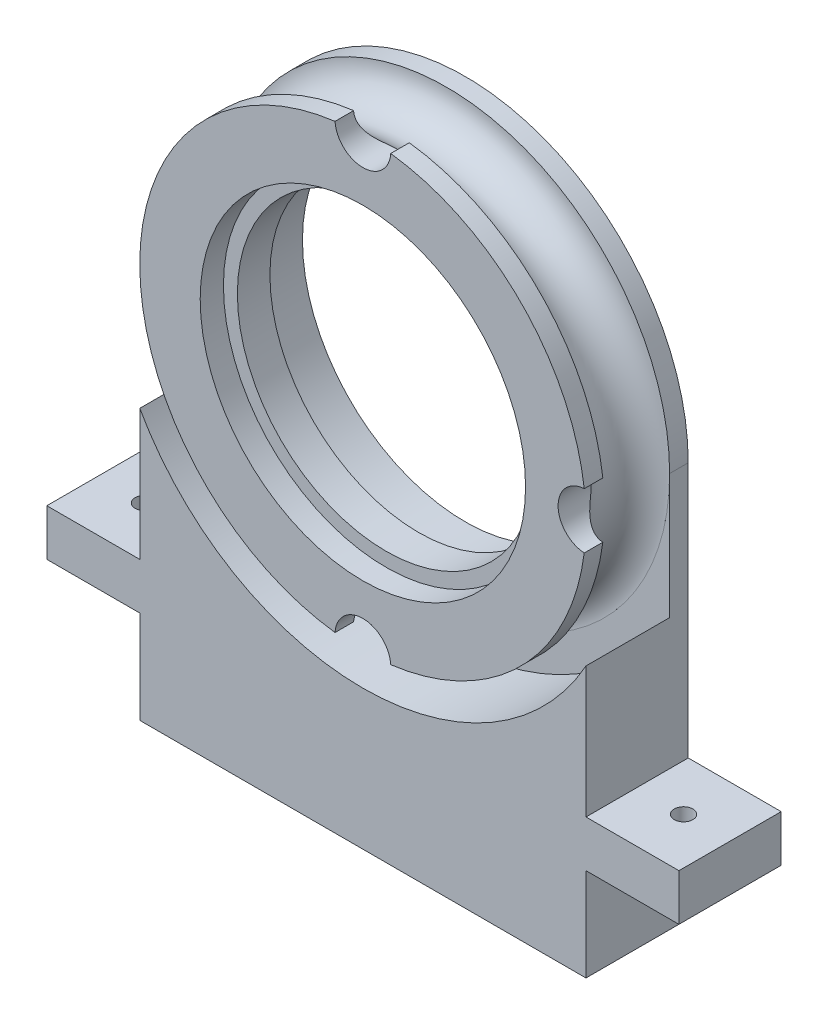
ISO-10303-21;
HEADER;
FILE_DESCRIPTION(('STEP AP214'),'2;1');
FILE_NAME('part.step','',(''),(''),'','','');
FILE_SCHEMA(('AUTOMOTIVE_DESIGN { 1 0 10303 214 1 1 1 1 }'));
ENDSEC;
DATA;
#1=APPLICATION_CONTEXT('core data for automotive mechanical design processes');
#2=APPLICATION_PROTOCOL_DEFINITION('international standard','automotive_design',2000,#1);
#3=PRODUCT_CONTEXT('',#1,'mechanical');
#4=PRODUCT('Part','Part','',(#3));
#5=PRODUCT_RELATED_PRODUCT_CATEGORY('part','',(#4));
#6=PRODUCT_DEFINITION_FORMATION('','',#4);
#7=PRODUCT_DEFINITION_CONTEXT('part definition',#1,'design');
#8=PRODUCT_DEFINITION('design','',#6,#7);
#9=PRODUCT_DEFINITION_SHAPE('','',#8);
#10=(LENGTH_UNIT() NAMED_UNIT(*) SI_UNIT(.MILLI.,.METRE.));
#11=(NAMED_UNIT(*) PLANE_ANGLE_UNIT() SI_UNIT($,.RADIAN.));
#12=(NAMED_UNIT(*) SI_UNIT($,.STERADIAN.) SOLID_ANGLE_UNIT());
#13=UNCERTAINTY_MEASURE_WITH_UNIT(LENGTH_MEASURE(1.E-05),#10,'distance_accuracy_value','');
#14=(GEOMETRIC_REPRESENTATION_CONTEXT(3) GLOBAL_UNCERTAINTY_ASSIGNED_CONTEXT((#13)) GLOBAL_UNIT_ASSIGNED_CONTEXT((#10,
#11,#12)) REPRESENTATION_CONTEXT('',''));
#15=CARTESIAN_POINT('',(0.,0.,0.));
#16=DIRECTION('',(0.,0.,1.));
#17=DIRECTION('',(1.,0.,0.));
#18=AXIS2_PLACEMENT_3D('',#15,#16,#17);
#19=CARTESIAN_POINT('',(0.,0.,11.));
#20=DIRECTION('',(0.,0.,1.));
#21=DIRECTION('',(1.,0.,0.));
#22=AXIS2_PLACEMENT_3D('',#19,#20,#21);
#23=PLANE('',#22);
#24=CARTESIAN_POINT('',(0.,0.,11.));
#25=DIRECTION('',(0.,0.,-1.));
#26=DIRECTION('',(1.,0.,0.));
#27=AXIS2_PLACEMENT_3D('',#24,#25,#26);
#28=CIRCLE('',#27,24.);
#29=CARTESIAN_POINT('',(23.8125,-2.99413489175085,11.));
#30=VERTEX_POINT('',#29);
#31=CARTESIAN_POINT('',(2.99413489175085,-23.8125,11.));
#32=VERTEX_POINT('',#31);
#33=EDGE_CURVE('E329',#30,#32,#28,.T.);
#34=ORIENTED_EDGE('',*,*,#33,.F.);
#35=CARTESIAN_POINT('',(24.,0.,11.));
#36=DIRECTION('',(0.,0.,1.));
#37=DIRECTION('',(1.,0.,0.));
#38=AXIS2_PLACEMENT_3D('',#35,#36,#37);
#39=CIRCLE('',#38,2.99999999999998);
#40=CARTESIAN_POINT('',(23.8125,2.99413489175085,11.));
#41=VERTEX_POINT('',#40);
#42=EDGE_CURVE('E479',#41,#30,#39,.T.);
#43=ORIENTED_EDGE('',*,*,#42,.F.);
#44=CARTESIAN_POINT('',(0.,0.,11.));
#45=DIRECTION('',(0.,0.,1.));
#46=DIRECTION('',(1.,0.,0.));
#47=AXIS2_PLACEMENT_3D('',#44,#45,#46);
#48=CIRCLE('',#47,24.);
#49=CARTESIAN_POINT('',(2.99413489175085,23.8125,11.));
#50=VERTEX_POINT('',#49);
#51=EDGE_CURVE('E333',#41,#50,#48,.T.);
#52=ORIENTED_EDGE('',*,*,#51,.T.);
#53=CARTESIAN_POINT('',(0.,24.,11.));
#54=DIRECTION('',(0.,0.,1.));
#55=DIRECTION('',(1.,0.,0.));
#56=AXIS2_PLACEMENT_3D('',#53,#54,#55);
#57=CIRCLE('',#56,2.99999999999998);
#58=CARTESIAN_POINT('',(-2.99413489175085,23.8125,11.));
#59=VERTEX_POINT('',#58);
#60=EDGE_CURVE('E470',#59,#50,#57,.T.);
#61=ORIENTED_EDGE('',*,*,#60,.F.);
#62=CARTESIAN_POINT('',(-2.99413489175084,-23.8125,11.));
#63=VERTEX_POINT('',#62);
#64=EDGE_CURVE('E338',#59,#63,#48,.T.);
#65=ORIENTED_EDGE('',*,*,#64,.T.);
#66=CARTESIAN_POINT('',(0.,-24.,11.));
#67=DIRECTION('',(0.,0.,1.));
#68=DIRECTION('',(1.,0.,0.));
#69=AXIS2_PLACEMENT_3D('',#66,#67,#68);
#70=CIRCLE('',#69,2.99999999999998);
#71=EDGE_CURVE('E235',#32,#63,#70,.T.);
#72=ORIENTED_EDGE('',*,*,#71,.F.);
#73=EDGE_LOOP('',(#34,#43,#52,#61,#65,#72));
#74=FACE_BOUND('',#73,.T.);
#75=CARTESIAN_POINT('',(0.,0.,11.));
#76=DIRECTION('',(0.,0.,1.));
#77=DIRECTION('',(1.,0.,0.));
#78=AXIS2_PLACEMENT_3D('',#75,#76,#77);
#79=CIRCLE('',#78,17.5);
#80=CARTESIAN_POINT('',(17.5,0.,11.));
#81=VERTEX_POINT('',#80);
#82=EDGE_CURVE('E230',#81,#81,#79,.T.);
#83=ORIENTED_EDGE('',*,*,#82,.F.);
#84=EDGE_LOOP('',(#83));
#85=FACE_BOUND('',#84,.T.);
#86=ADVANCED_FACE('F40',(#74,#85),#23,.T.);
#87=CARTESIAN_POINT('',(24.,-27.5,11.));
#88=DIRECTION('',(-1.,0.,0.));
#89=DIRECTION('',(0.,0.,1.));
#90=AXIS2_PLACEMENT_3D('',#87,#88,#89);
#91=PLANE('',#90);
#92=DIRECTION('',(0.,1.,0.));
#93=VECTOR('',#92,1.);
#94=CARTESIAN_POINT('',(24.,0.,2.));
#95=LINE('',#94,#93);
#96=CARTESIAN_POINT('',(24.,-13.4257215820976,2.));
#97=VERTEX_POINT('',#96);
#98=CARTESIAN_POINT('',(24.,0.,2.));
#99=VERTEX_POINT('',#98);
#100=EDGE_CURVE('E184',#97,#99,#95,.T.);
#101=ORIENTED_EDGE('',*,*,#100,.F.);
#102=DIRECTION('',(0.,0.,1.));
#103=VECTOR('',#102,1.);
#104=CARTESIAN_POINT('',(24.,-13.4257215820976,2.));
#105=LINE('',#104,#103);
#106=CARTESIAN_POINT('',(24.,-13.4257215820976,11.));
#107=VERTEX_POINT('',#106);
#108=EDGE_CURVE('E271',#97,#107,#105,.T.);
#109=ORIENTED_EDGE('',*,*,#108,.T.);
#110=DIRECTION('',(0.,1.,0.));
#111=VECTOR('',#110,1.);
#112=CARTESIAN_POINT('',(24.,-27.5,11.));
#113=LINE('',#112,#111);
#114=CARTESIAN_POINT('',(24.,-27.5,11.));
#115=VERTEX_POINT('',#114);
#116=EDGE_CURVE('E326',#115,#107,#113,.T.);
#117=ORIENTED_EDGE('',*,*,#116,.F.);
#118=DIRECTION('',(0.,0.,-1.));
#119=VECTOR('',#118,1.);
#120=CARTESIAN_POINT('',(24.,-27.5,11.));
#121=LINE('',#120,#119);
#122=CARTESIAN_POINT('',(24.,-27.5,0.));
#123=VERTEX_POINT('',#122);
#124=EDGE_CURVE('E206',#115,#123,#121,.T.);
#125=ORIENTED_EDGE('',*,*,#124,.T.);
#126=DIRECTION('',(0.,1.,0.));
#127=VECTOR('',#126,1.);
#128=CARTESIAN_POINT('',(24.,-27.5,0.));
#129=LINE('',#128,#127);
#130=CARTESIAN_POINT('',(24.,0.,0.));
#131=VERTEX_POINT('',#130);
#132=EDGE_CURVE('E359',#123,#131,#129,.T.);
#133=ORIENTED_EDGE('',*,*,#132,.T.);
#134=DIRECTION('',(0.,0.,-1.));
#135=VECTOR('',#134,1.);
#136=CARTESIAN_POINT('',(24.,0.,11.));
#137=LINE('',#136,#135);
#138=EDGE_CURVE('E203',#99,#131,#137,.T.);
#139=ORIENTED_EDGE('',*,*,#138,.F.);
#140=EDGE_LOOP('',(#101,#109,#117,#125,#133,#139));
#141=FACE_BOUND('',#140,.T.);
#142=ADVANCED_FACE('F297',(#141),#91,.F.);
#143=CARTESIAN_POINT('',(0.,0.,11.));
#144=DIRECTION('',(0.,0.,-1.));
#145=DIRECTION('',(-1.,0.,0.));
#146=AXIS2_PLACEMENT_3D('',#143,#144,#145);
#147=CYLINDRICAL_SURFACE('',#146,24.);
#148=CARTESIAN_POINT('',(0.,0.,2.));
#149=DIRECTION('',(0.,0.,-1.));
#150=DIRECTION('',(1.,0.,0.));
#151=AXIS2_PLACEMENT_3D('',#148,#149,#150);
#152=CIRCLE('',#151,24.);
#153=CARTESIAN_POINT('',(-24.,0.,2.));
#154=VERTEX_POINT('',#153);
#155=EDGE_CURVE('E177',#99,#154,#152,.T.);
#156=ORIENTED_EDGE('',*,*,#155,.F.);
#157=ORIENTED_EDGE('',*,*,#138,.T.);
#158=CARTESIAN_POINT('',(0.,0.,0.));
#159=DIRECTION('',(0.,0.,1.));
#160=DIRECTION('',(1.,0.,0.));
#161=AXIS2_PLACEMENT_3D('',#158,#159,#160);
#162=CIRCLE('',#161,24.);
#163=CARTESIAN_POINT('',(-24.,0.,0.));
#164=VERTEX_POINT('',#163);
#165=EDGE_CURVE('E201',#131,#164,#162,.T.);
#166=ORIENTED_EDGE('',*,*,#165,.T.);
#167=DIRECTION('',(0.,0.,-1.));
#168=VECTOR('',#167,1.);
#169=CARTESIAN_POINT('',(-24.,0.,11.));
#170=LINE('',#169,#168);
#171=EDGE_CURVE('E193',#154,#164,#170,.T.);
#172=ORIENTED_EDGE('',*,*,#171,.F.);
#173=EDGE_LOOP('',(#156,#157,#166,#172));
#174=FACE_BOUND('',#173,.T.);
#175=CARTESIAN_POINT('',(0.,0.,2.00115733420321));
#176=DIRECTION('',(0.,0.,1.));
#177=DIRECTION('',(1.,0.,0.));
#178=AXIS2_PLACEMENT_3D('',#175,#176,#177);
#179=CIRCLE('',#178,24.);
#180=CARTESIAN_POINT('',(24.,0.,2.00115733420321));
#181=VERTEX_POINT('',#180);
#182=EDGE_CURVE('E498',#181,#181,#179,.T.);
#183=ORIENTED_EDGE('',*,*,#182,.F.);
#184=EDGE_LOOP('',(#183));
#185=FACE_BOUND('',#184,.T.);
#186=ADVANCED_FACE('F198',(#174,#185),#147,.T.);
#187=CARTESIAN_POINT('',(0.,0.,8.99884266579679));
#188=DIRECTION('',(0.,0.,-1.));
#189=DIRECTION('',(-1.,0.,0.));
#190=AXIS2_PLACEMENT_3D('',#187,#188,#189);
#191=CIRCLE('',#190,24.);
#192=CARTESIAN_POINT('',(-2.99413489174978,-23.8125000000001,8.99884266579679));
#193=VERTEX_POINT('',#192);
#194=CARTESIAN_POINT('',(-2.99413489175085,23.8125,8.99884266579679));
#195=VERTEX_POINT('',#194);
#196=EDGE_CURVE('E500',#193,#195,#191,.T.);
#197=ORIENTED_EDGE('',*,*,#196,.F.);
#198=DIRECTION('',(0.,0.,1.));
#199=VECTOR('',#198,1.);
#200=CARTESIAN_POINT('',(-2.99413489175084,-23.8125,4.));
#201=LINE('',#200,#199);
#202=EDGE_CURVE('E476',#193,#63,#201,.T.);
#203=ORIENTED_EDGE('',*,*,#202,.T.);
#204=ORIENTED_EDGE('',*,*,#64,.F.);
#205=DIRECTION('',(0.,0.,1.));
#206=VECTOR('',#205,1.);
#207=CARTESIAN_POINT('',(-2.99413489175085,23.8125,4.));
#208=LINE('',#207,#206);
#209=EDGE_CURVE('E468',#195,#59,#208,.T.);
#210=ORIENTED_EDGE('',*,*,#209,.F.);
#211=EDGE_LOOP('',(#197,#203,#204,#210));
#212=FACE_BOUND('',#211,.T.);
#213=ADVANCED_FACE('F425',(#212),#147,.T.);
#214=CARTESIAN_POINT('',(2.99413489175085,23.8125,8.99884266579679));
#215=VERTEX_POINT('',#214);
#216=CARTESIAN_POINT('',(23.8125,2.99413489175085,8.99884266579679));
#217=VERTEX_POINT('',#216);
#218=EDGE_CURVE('E55',#215,#217,#191,.T.);
#219=ORIENTED_EDGE('',*,*,#218,.F.);
#220=DIRECTION('',(0.,0.,1.));
#221=VECTOR('',#220,1.);
#222=CARTESIAN_POINT('',(2.99413489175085,23.8125,4.));
#223=LINE('',#222,#221);
#224=EDGE_CURVE('E467',#215,#50,#223,.T.);
#225=ORIENTED_EDGE('',*,*,#224,.T.);
#226=ORIENTED_EDGE('',*,*,#51,.F.);
#227=DIRECTION('',(0.,0.,1.));
#228=VECTOR('',#227,1.);
#229=CARTESIAN_POINT('',(23.8125,2.99413489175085,4.));
#230=LINE('',#229,#228);
#231=EDGE_CURVE('E482',#217,#41,#230,.T.);
#232=ORIENTED_EDGE('',*,*,#231,.F.);
#233=EDGE_LOOP('',(#219,#225,#226,#232));
#234=FACE_BOUND('',#233,.T.);
#235=ADVANCED_FACE('F423',(#234),#147,.T.);
#236=CARTESIAN_POINT('',(-24.,0.,11.));
#237=DIRECTION('',(1.,0.,0.));
#238=DIRECTION('',(0.,1.,0.));
#239=AXIS2_PLACEMENT_3D('',#236,#237,#238);
#240=PLANE('',#239);
#241=DIRECTION('',(0.,-1.,0.));
#242=VECTOR('',#241,1.);
#243=CARTESIAN_POINT('',(-24.,0.,11.));
#244=LINE('',#243,#242);
#245=CARTESIAN_POINT('',(-24.,-13.4257215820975,11.));
#246=VERTEX_POINT('',#245);
#247=CARTESIAN_POINT('',(-24.,-27.5,11.));
#248=VERTEX_POINT('',#247);
#249=EDGE_CURVE('E323',#246,#248,#244,.T.);
#250=ORIENTED_EDGE('',*,*,#249,.F.);
#251=DIRECTION('',(0.,0.,1.));
#252=VECTOR('',#251,1.);
#253=CARTESIAN_POINT('',(-24.,-13.4257215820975,2.));
#254=LINE('',#253,#252);
#255=CARTESIAN_POINT('',(-24.,-13.4257215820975,2.));
#256=VERTEX_POINT('',#255);
#257=EDGE_CURVE('E195',#256,#246,#254,.T.);
#258=ORIENTED_EDGE('',*,*,#257,.F.);
#259=DIRECTION('',(0.,-1.,0.));
#260=VECTOR('',#259,1.);
#261=CARTESIAN_POINT('',(-24.,0.,2.));
#262=LINE('',#261,#260);
#263=EDGE_CURVE('E181',#154,#256,#262,.T.);
#264=ORIENTED_EDGE('',*,*,#263,.F.);
#265=ORIENTED_EDGE('',*,*,#171,.T.);
#266=DIRECTION('',(0.,-1.,0.));
#267=VECTOR('',#266,1.);
#268=CARTESIAN_POINT('',(-24.,0.,0.));
#269=LINE('',#268,#267);
#270=CARTESIAN_POINT('',(-24.,-27.5,0.));
#271=VERTEX_POINT('',#270);
#272=EDGE_CURVE('E363',#164,#271,#269,.T.);
#273=ORIENTED_EDGE('',*,*,#272,.T.);
#274=DIRECTION('',(0.,0.,-1.));
#275=VECTOR('',#274,1.);
#276=CARTESIAN_POINT('',(-24.,-27.5,11.));
#277=LINE('',#276,#275);
#278=EDGE_CURVE('E204',#248,#271,#277,.T.);
#279=ORIENTED_EDGE('',*,*,#278,.F.);
#280=EDGE_LOOP('',(#250,#258,#264,#265,#273,#279));
#281=FACE_BOUND('',#280,.T.);
#282=ADVANCED_FACE('F192',(#281),#240,.F.);
#283=CARTESIAN_POINT('',(0.,24.,4.));
#284=DIRECTION('',(0.,0.,1.));
#285=DIRECTION('',(1.,0.,0.));
#286=AXIS2_PLACEMENT_3D('',#283,#284,#285);
#287=CYLINDRICAL_SURFACE('',#286,2.99999999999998);
#288=CARTESIAN_POINT('',(-2.99414740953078,23.8127,8.99883751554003));
#289=CARTESIAN_POINT('',(-2.98981562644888,23.7431989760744,9.00064569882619));
#290=CARTESIAN_POINT('',(-2.98302988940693,23.6738038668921,9.00035445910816));
#291=CARTESIAN_POINT('',(-2.96468538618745,23.5358272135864,8.9956261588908));
#292=CARTESIAN_POINT('',(-2.95312919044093,23.4672452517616,8.99119132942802));
#293=CARTESIAN_POINT('',(-2.92547653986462,23.3319238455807,8.97827872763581));
#294=CARTESIAN_POINT('',(-2.90941436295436,23.2651745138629,8.96983115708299));
#295=CARTESIAN_POINT('',(-2.87295172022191,23.1335002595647,8.94907754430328));
#296=CARTESIAN_POINT('',(-2.85255092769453,23.068575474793,8.93677121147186));
#297=CARTESIAN_POINT('',(-2.7853235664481,22.8774384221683,8.89444135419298));
#298=CARTESIAN_POINT('',(-2.73239572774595,22.7544987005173,8.8589704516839));
#299=CARTESIAN_POINT('',(-2.61277709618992,22.5198586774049,8.77591676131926));
#300=CARTESIAN_POINT('',(-2.54606372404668,22.4081772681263,8.72831407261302));
#301=CARTESIAN_POINT('',(-2.42412100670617,22.2304431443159,8.64030871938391));
#302=CARTESIAN_POINT('',(-2.37186831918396,22.1610783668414,8.60234239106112));
#303=CARTESIAN_POINT('',(-2.2626636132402,22.0282637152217,8.52297309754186));
#304=CARTESIAN_POINT('',(-2.20571134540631,21.9648141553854,8.48156994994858));
#305=CARTESIAN_POINT('',(-2.08742045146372,21.8436444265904,8.3961156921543));
#306=CARTESIAN_POINT('',(-2.0260690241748,21.7859422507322,8.35205691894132));
#307=CARTESIAN_POINT('',(-1.89946779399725,21.6764195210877,8.26235111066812));
#308=CARTESIAN_POINT('',(-1.83421935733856,21.6245969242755,8.2167046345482));
#309=CARTESIAN_POINT('',(-1.69827777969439,21.5255094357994,8.12365912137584));
#310=CARTESIAN_POINT('',(-1.62748979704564,21.4783892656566,8.07624468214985));
#311=CARTESIAN_POINT('',(-1.48186155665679,21.390145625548,7.98197054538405));
#312=CARTESIAN_POINT('',(-1.40701963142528,21.3490246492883,7.93511108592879));
#313=CARTESIAN_POINT('',(-1.25326974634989,21.2729775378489,7.84361241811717));
#314=CARTESIAN_POINT('',(-1.1743737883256,21.2380343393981,7.7989673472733));
#315=CARTESIAN_POINT('',(-1.01199273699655,21.1744974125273,7.71381139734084));
#316=CARTESIAN_POINT('',(-0.92851243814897,21.1458972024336,7.67329632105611));
#317=CARTESIAN_POINT('',(-0.754963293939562,21.0951174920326,7.59846714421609));
#318=CARTESIAN_POINT('',(-0.664804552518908,21.0730594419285,7.56427430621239));
#319=CARTESIAN_POINT('',(-0.479572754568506,21.037084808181,7.50694734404));
#320=CARTESIAN_POINT('',(-0.384513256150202,21.0231469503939,7.48378435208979));
#321=CARTESIAN_POINT('',(-0.189655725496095,21.0043887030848,7.45230217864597));
#322=CARTESIAN_POINT('',(-0.0898128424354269,20.9996863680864,7.44417527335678));
#323=CARTESIAN_POINT('',(0.10974272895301,21.0003467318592,7.44530288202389));
#324=CARTESIAN_POINT('',(0.209455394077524,21.0057110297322,7.45456015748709));
#325=CARTESIAN_POINT('',(0.41637245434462,21.0270052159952,7.49021200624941));
#326=CARTESIAN_POINT('',(0.52311967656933,21.0440792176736,7.51845496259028));
#327=CARTESIAN_POINT('',(0.730239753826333,21.0882900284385,7.58794562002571));
#328=CARTESIAN_POINT('',(0.830587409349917,21.1154640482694,7.62924132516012));
#329=CARTESIAN_POINT('',(1.01047466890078,21.1739566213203,7.7129005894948));
#330=CARTESIAN_POINT('',(1.09090957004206,21.2040856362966,7.75422233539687));
#331=CARTESIAN_POINT('',(1.24748151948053,21.2703440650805,7.84016537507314));
#332=CARTESIAN_POINT('',(1.32361548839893,21.3064777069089,7.88478898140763));
#333=CARTESIAN_POINT('',(1.47200297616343,21.3846130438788,7.97565102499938));
#334=CARTESIAN_POINT('',(1.54424931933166,21.4266251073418,8.02189220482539));
#335=CARTESIAN_POINT('',(1.68488564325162,21.5164304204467,8.11457066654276));
#336=CARTESIAN_POINT('',(1.75327658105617,21.5642222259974,8.16100789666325));
#337=CARTESIAN_POINT('',(1.8906408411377,21.6690287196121,8.25604678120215));
#338=CARTESIAN_POINT('',(1.95935109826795,21.7264451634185,8.30458731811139));
#339=CARTESIAN_POINT('',(2.09218728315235,21.848056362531,8.39947253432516));
#340=CARTESIAN_POINT('',(2.15631226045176,21.9122525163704,8.44581675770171));
#341=CARTESIAN_POINT('',(2.27933028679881,22.0473173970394,8.53504315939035));
#342=CARTESIAN_POINT('',(2.33823727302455,22.1181672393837,8.57793453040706));
#343=CARTESIAN_POINT('',(2.45029808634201,22.2665970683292,8.65924393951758));
#344=CARTESIAN_POINT('',(2.50345496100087,22.3441734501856,8.6976643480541));
#345=CARTESIAN_POINT('',(2.62245388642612,22.5371110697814,8.78268447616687));
#346=CARTESIAN_POINT('',(2.68529241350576,22.6555143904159,8.82673219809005));
#347=CARTESIAN_POINT('',(2.79556632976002,22.9031360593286,8.90112683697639));
#348=CARTESIAN_POINT('',(2.84303059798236,23.032333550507,8.93149948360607));
#349=CARTESIAN_POINT('',(2.91177835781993,23.2697045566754,8.97149557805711));
#350=CARTESIAN_POINT('',(2.93650721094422,23.3763616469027,8.98419027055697));
#351=CARTESIAN_POINT('',(2.96481255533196,23.5385633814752,8.99551895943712));
#352=CARTESIAN_POINT('',(2.97279044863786,23.5931166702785,8.99800669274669));
#353=CARTESIAN_POINT('',(2.98573797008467,23.7026539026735,9.00037811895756));
#354=CARTESIAN_POINT('',(2.99070657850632,23.7576379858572,9.00026092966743));
#355=CARTESIAN_POINT('',(2.99414740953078,23.8127,8.99883751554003));
#356=B_SPLINE_CURVE_WITH_KNOTS('',3,(#288,#289,#290,#291,#292,#293,#294,#295,#296,#297,#298,
#299,#300,#301,#302,#303,#304,#305,#306,#307,#308,#309,#310,#311,#312,#313,#314,#315,#316,#317,
#318,#319,#320,#321,#322,#323,#324,#325,#326,#327,#328,#329,#330,#331,#332,#333,#334,#335,#336,
#337,#338,#339,#340,#341,#342,#343,#344,#345,#346,#347,#348,#349,#350,#351,#352,#353,#354,#355),
.UNSPECIFIED.,.F.,.F.,(4,2,2,2,2,2,2,2,2,2,2,2,2,2,2,2,2,2,2,2,2,2,2,2,2,2,2,2,2,2,2,2,2,4),(0.,
0.208892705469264,0.417673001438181,0.624906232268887,0.832155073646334,1.24554456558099,
1.659616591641,1.94360235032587,2.22760319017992,2.51246689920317,2.79723131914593,
3.08905060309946,3.38099084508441,3.672111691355,3.9629336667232,4.25885791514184,
4.55400334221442,4.85289757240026,5.15183928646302,5.48515972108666,5.81972055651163,
6.10529176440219,6.39106490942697,6.6773486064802,6.96356092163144,7.2687845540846,
7.57407127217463,7.87851630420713,8.18279918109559,8.60431859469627,9.02504157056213,
9.35452955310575,9.51996858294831,9.68546364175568),.UNSPECIFIED.);
#357=EDGE_CURVE('E501',#195,#215,#356,.T.);
#358=ORIENTED_EDGE('',*,*,#357,.F.);
#359=ORIENTED_EDGE('',*,*,#209,.T.);
#360=ORIENTED_EDGE('',*,*,#60,.T.);
#361=ORIENTED_EDGE('',*,*,#224,.F.);
#362=EDGE_LOOP('',(#358,#359,#360,#361));
#363=FACE_BOUND('',#362,.T.);
#364=ADVANCED_FACE('F277',(#363),#287,.F.);
#365=CARTESIAN_POINT('',(24.,0.,4.));
#366=DIRECTION('',(0.,0.,1.));
#367=DIRECTION('',(1.,0.,0.));
#368=AXIS2_PLACEMENT_3D('',#365,#366,#367);
#369=CYLINDRICAL_SURFACE('',#368,2.99999999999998);
#370=CARTESIAN_POINT('',(23.8127,2.99414740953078,8.99883751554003));
#371=CARTESIAN_POINT('',(23.7431989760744,2.98981562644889,9.00064569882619));
#372=CARTESIAN_POINT('',(23.6738038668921,2.98302988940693,9.00035445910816));
#373=CARTESIAN_POINT('',(23.5358272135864,2.96468538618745,8.9956261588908));
#374=CARTESIAN_POINT('',(23.4672452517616,2.95312919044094,8.99119132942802));
#375=CARTESIAN_POINT('',(23.3319238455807,2.92547653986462,8.97827872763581));
#376=CARTESIAN_POINT('',(23.2651745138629,2.90941436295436,8.96983115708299));
#377=CARTESIAN_POINT('',(23.1335002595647,2.87295172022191,8.94907754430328));
#378=CARTESIAN_POINT('',(23.068575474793,2.85255092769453,8.93677121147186));
#379=CARTESIAN_POINT('',(22.8774384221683,2.7853235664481,8.89444135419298));
#380=CARTESIAN_POINT('',(22.7544987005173,2.73239572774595,8.8589704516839));
#381=CARTESIAN_POINT('',(22.5198586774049,2.61277709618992,8.77591676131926));
#382=CARTESIAN_POINT('',(22.4081772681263,2.54606372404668,8.72831407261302));
#383=CARTESIAN_POINT('',(22.2304431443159,2.42412100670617,8.64030871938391));
#384=CARTESIAN_POINT('',(22.1610783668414,2.37186831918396,8.60234239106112));
#385=CARTESIAN_POINT('',(22.0282637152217,2.26266361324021,8.52297309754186));
#386=CARTESIAN_POINT('',(21.9648141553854,2.20571134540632,8.48156994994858));
#387=CARTESIAN_POINT('',(21.8436444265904,2.08742045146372,8.39611569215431));
#388=CARTESIAN_POINT('',(21.7859422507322,2.0260690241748,8.35205691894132));
#389=CARTESIAN_POINT('',(21.6764195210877,1.89946779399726,8.26235111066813));
#390=CARTESIAN_POINT('',(21.6245969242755,1.83421935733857,8.21670463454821));
#391=CARTESIAN_POINT('',(21.5255094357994,1.69827777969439,8.12365912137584));
#392=CARTESIAN_POINT('',(21.4783892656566,1.62748979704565,8.07624468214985));
#393=CARTESIAN_POINT('',(21.390145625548,1.4818615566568,7.98197054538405));
#394=CARTESIAN_POINT('',(21.3490246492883,1.40701963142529,7.93511108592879));
#395=CARTESIAN_POINT('',(21.2729775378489,1.25326974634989,7.84361241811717));
#396=CARTESIAN_POINT('',(21.2380343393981,1.17437378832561,7.79896734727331));
#397=CARTESIAN_POINT('',(21.1744974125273,1.01199273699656,7.71381139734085));
#398=CARTESIAN_POINT('',(21.1458972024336,0.928512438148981,7.67329632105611));
#399=CARTESIAN_POINT('',(21.0951174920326,0.754963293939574,7.5984671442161));
#400=CARTESIAN_POINT('',(21.0730594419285,0.66480455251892,7.56427430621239));
#401=CARTESIAN_POINT('',(21.037084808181,0.479572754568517,7.50694734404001));
#402=CARTESIAN_POINT('',(21.0231469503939,0.384513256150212,7.4837843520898));
#403=CARTESIAN_POINT('',(21.0043887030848,0.189655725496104,7.45230217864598));
#404=CARTESIAN_POINT('',(20.9996863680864,0.0898128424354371,7.44417527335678));
#405=CARTESIAN_POINT('',(21.0003467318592,-0.109742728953,7.44530288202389));
#406=CARTESIAN_POINT('',(21.0057110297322,-0.209455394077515,7.45456015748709));
#407=CARTESIAN_POINT('',(21.0270052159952,-0.41637245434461,7.49021200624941));
#408=CARTESIAN_POINT('',(21.0440792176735,-0.523119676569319,7.51845496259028));
#409=CARTESIAN_POINT('',(21.0882900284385,-0.730239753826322,7.58794562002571));
#410=CARTESIAN_POINT('',(21.1154640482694,-0.830587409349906,7.62924132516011));
#411=CARTESIAN_POINT('',(21.1739566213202,-1.01047466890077,7.7129005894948));
#412=CARTESIAN_POINT('',(21.2040856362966,-1.09090957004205,7.75422233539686));
#413=CARTESIAN_POINT('',(21.2703440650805,-1.24748151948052,7.84016537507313));
#414=CARTESIAN_POINT('',(21.3064777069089,-1.32361548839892,7.88478898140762));
#415=CARTESIAN_POINT('',(21.3846130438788,-1.47200297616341,7.97565102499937));
#416=CARTESIAN_POINT('',(21.4266251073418,-1.54424931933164,8.02189220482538));
#417=CARTESIAN_POINT('',(21.5164304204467,-1.6848856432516,8.11457066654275));
#418=CARTESIAN_POINT('',(21.5642222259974,-1.75327658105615,8.16100789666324));
#419=CARTESIAN_POINT('',(21.6690287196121,-1.89064084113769,8.25604678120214));
#420=CARTESIAN_POINT('',(21.7264451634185,-1.95935109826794,8.30458731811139));
#421=CARTESIAN_POINT('',(21.848056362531,-2.09218728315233,8.39947253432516));
#422=CARTESIAN_POINT('',(21.9122525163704,-2.15631226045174,8.4458167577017));
#423=CARTESIAN_POINT('',(22.0473173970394,-2.27933028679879,8.53504315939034));
#424=CARTESIAN_POINT('',(22.1181672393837,-2.33823727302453,8.57793453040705));
#425=CARTESIAN_POINT('',(22.2665970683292,-2.450298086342,8.65924393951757));
#426=CARTESIAN_POINT('',(22.3441734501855,-2.50345496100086,8.69766434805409));
#427=CARTESIAN_POINT('',(22.5371110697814,-2.62245388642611,8.78268447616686));
#428=CARTESIAN_POINT('',(22.6555143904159,-2.68529241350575,8.82673219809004));
#429=CARTESIAN_POINT('',(22.9031360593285,-2.79556632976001,8.90112683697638));
#430=CARTESIAN_POINT('',(23.032333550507,-2.84303059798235,8.93149948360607));
#431=CARTESIAN_POINT('',(23.2697045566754,-2.91177835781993,8.9714955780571));
#432=CARTESIAN_POINT('',(23.3763616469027,-2.93650721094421,8.98419027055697));
#433=CARTESIAN_POINT('',(23.5385633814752,-2.96481255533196,8.99551895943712));
#434=CARTESIAN_POINT('',(23.5931166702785,-2.97279044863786,8.99800669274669));
#435=CARTESIAN_POINT('',(23.7026539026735,-2.98573797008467,9.00037811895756));
#436=CARTESIAN_POINT('',(23.7576379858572,-2.99070657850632,9.00026092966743));
#437=CARTESIAN_POINT('',(23.8127,-2.99414740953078,8.99883751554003));
#438=B_SPLINE_CURVE_WITH_KNOTS('',3,(#370,#371,#372,#373,#374,#375,#376,#377,#378,#379,#380,
#381,#382,#383,#384,#385,#386,#387,#388,#389,#390,#391,#392,#393,#394,#395,#396,#397,#398,#399,
#400,#401,#402,#403,#404,#405,#406,#407,#408,#409,#410,#411,#412,#413,#414,#415,#416,#417,#418,
#419,#420,#421,#422,#423,#424,#425,#426,#427,#428,#429,#430,#431,#432,#433,#434,#435,#436,#437),
.UNSPECIFIED.,.F.,.F.,(4,2,2,2,2,2,2,2,2,2,2,2,2,2,2,2,2,2,2,2,2,2,2,2,2,2,2,2,2,2,2,2,2,4),(0.,
0.208892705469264,0.417673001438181,0.624906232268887,0.832155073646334,1.24554456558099,
1.659616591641,1.94360235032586,2.22760319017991,2.51246689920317,2.79723131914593,
3.08905060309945,3.3809908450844,3.67211169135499,3.96293366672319,4.25885791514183,
4.55400334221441,4.85289757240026,5.15183928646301,5.48515972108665,5.81972055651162,
6.10529176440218,6.39106490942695,6.67734860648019,6.96356092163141,7.26878455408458,
7.57407127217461,7.8785163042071,8.18279918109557,8.60431859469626,9.02504157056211,
9.35452955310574,9.51996858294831,9.68546364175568),.UNSPECIFIED.);
#439=CARTESIAN_POINT('',(23.8125,-2.99413489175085,8.99884266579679));
#440=VERTEX_POINT('',#439);
#441=EDGE_CURVE('E265',#217,#440,#438,.T.);
#442=ORIENTED_EDGE('',*,*,#441,.F.);
#443=ORIENTED_EDGE('',*,*,#231,.T.);
#444=ORIENTED_EDGE('',*,*,#42,.T.);
#445=DIRECTION('',(0.,0.,1.));
#446=VECTOR('',#445,1.);
#447=CARTESIAN_POINT('',(23.8125,-2.99413489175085,4.));
#448=LINE('',#447,#446);
#449=EDGE_CURVE('E474',#440,#30,#448,.T.);
#450=ORIENTED_EDGE('',*,*,#449,.F.);
#451=EDGE_LOOP('',(#442,#443,#444,#450));
#452=FACE_BOUND('',#451,.T.);
#453=ADVANCED_FACE('F273',(#452),#369,.F.);
#454=CARTESIAN_POINT('',(0.,-24.,4.));
#455=DIRECTION('',(0.,0.,1.));
#456=DIRECTION('',(1.,0.,0.));
#457=AXIS2_PLACEMENT_3D('',#454,#455,#456);
#458=CYLINDRICAL_SURFACE('',#457,2.99999999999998);
#459=CARTESIAN_POINT('',(2.99414740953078,-23.8127,8.99883751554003));
#460=CARTESIAN_POINT('',(2.98981562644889,-23.7431989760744,9.00064569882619));
#461=CARTESIAN_POINT('',(2.98302988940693,-23.6738038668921,9.00035445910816));
#462=CARTESIAN_POINT('',(2.96468538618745,-23.5358272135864,8.9956261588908));
#463=CARTESIAN_POINT('',(2.95312919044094,-23.4672452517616,8.99119132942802));
#464=CARTESIAN_POINT('',(2.92547653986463,-23.3319238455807,8.97827872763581));
#465=CARTESIAN_POINT('',(2.90941436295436,-23.2651745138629,8.96983115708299));
#466=CARTESIAN_POINT('',(2.87295172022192,-23.1335002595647,8.94907754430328));
#467=CARTESIAN_POINT('',(2.85255092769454,-23.068575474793,8.93677121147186));
#468=CARTESIAN_POINT('',(2.78532356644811,-22.8774384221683,8.89444135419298));
#469=CARTESIAN_POINT('',(2.73239572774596,-22.7544987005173,8.8589704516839));
#470=CARTESIAN_POINT('',(2.61277709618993,-22.5198586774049,8.77591676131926));
#471=CARTESIAN_POINT('',(2.54606372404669,-22.4081772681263,8.72831407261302));
#472=CARTESIAN_POINT('',(2.42412100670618,-22.2304431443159,8.64030871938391));
#473=CARTESIAN_POINT('',(2.37186831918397,-22.1610783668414,8.60234239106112));
#474=CARTESIAN_POINT('',(2.26266361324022,-22.0282637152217,8.52297309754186));
#475=CARTESIAN_POINT('',(2.20571134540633,-21.9648141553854,8.48156994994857));
#476=CARTESIAN_POINT('',(2.08742045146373,-21.8436444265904,8.39611569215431));
#477=CARTESIAN_POINT('',(2.02606902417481,-21.7859422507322,8.35205691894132));
#478=CARTESIAN_POINT('',(1.89946779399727,-21.6764195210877,8.26235111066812));
#479=CARTESIAN_POINT('',(1.83421935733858,-21.6245969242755,8.21670463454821));
#480=CARTESIAN_POINT('',(1.6982777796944,-21.5255094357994,8.12365912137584));
#481=CARTESIAN_POINT('',(1.62748979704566,-21.4783892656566,8.07624468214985));
#482=CARTESIAN_POINT('',(1.48186155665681,-21.390145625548,7.98197054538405));
#483=CARTESIAN_POINT('',(1.4070196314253,-21.3490246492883,7.93511108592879));
#484=CARTESIAN_POINT('',(1.2532697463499,-21.2729775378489,7.84361241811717));
#485=CARTESIAN_POINT('',(1.17437378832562,-21.2380343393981,7.7989673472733));
#486=CARTESIAN_POINT('',(1.01199273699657,-21.1744974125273,7.71381139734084));
#487=CARTESIAN_POINT('',(0.928512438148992,-21.1458972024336,7.67329632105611));
#488=CARTESIAN_POINT('',(0.754963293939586,-21.0951174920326,7.59846714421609));
#489=CARTESIAN_POINT('',(0.664804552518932,-21.0730594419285,7.56427430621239));
#490=CARTESIAN_POINT('',(0.479572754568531,-21.037084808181,7.50694734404));
#491=CARTESIAN_POINT('',(0.384513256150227,-21.0231469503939,7.48378435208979));
#492=CARTESIAN_POINT('',(0.18965572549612,-21.0043887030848,7.45230217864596));
#493=CARTESIAN_POINT('',(0.0898128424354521,-20.9996863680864,7.44417527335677));
#494=CARTESIAN_POINT('',(-0.109742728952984,-21.0003467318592,7.44530288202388));
#495=CARTESIAN_POINT('',(-0.209455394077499,-21.0057110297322,7.45456015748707));
#496=CARTESIAN_POINT('',(-0.416372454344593,-21.0270052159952,7.49021200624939));
#497=CARTESIAN_POINT('',(-0.523119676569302,-21.0440792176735,7.51845496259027));
#498=CARTESIAN_POINT('',(-0.730239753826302,-21.0882900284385,7.58794562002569));
#499=CARTESIAN_POINT('',(-0.830587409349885,-21.1154640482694,7.62924132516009));
#500=CARTESIAN_POINT('',(-1.01047466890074,-21.1739566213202,7.71290058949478));
#501=CARTESIAN_POINT('',(-1.09090957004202,-21.2040856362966,7.75422233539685));
#502=CARTESIAN_POINT('',(-1.24748151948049,-21.2703440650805,7.84016537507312));
#503=CARTESIAN_POINT('',(-1.3236154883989,-21.3064777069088,7.88478898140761));
#504=CARTESIAN_POINT('',(-1.47200297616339,-21.3846130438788,7.97565102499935));
#505=CARTESIAN_POINT('',(-1.54424931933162,-21.4266251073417,8.02189220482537));
#506=CARTESIAN_POINT('',(-1.68488564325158,-21.5164304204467,8.11457066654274));
#507=CARTESIAN_POINT('',(-1.75327658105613,-21.5642222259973,8.16100789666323));
#508=CARTESIAN_POINT('',(-1.89064084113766,-21.6690287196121,8.25604678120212));
#509=CARTESIAN_POINT('',(-1.95935109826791,-21.7264451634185,8.30458731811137));
#510=CARTESIAN_POINT('',(-2.09218728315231,-21.8480563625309,8.39947253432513));
#511=CARTESIAN_POINT('',(-2.15631226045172,-21.9122525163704,8.44581675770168));
#512=CARTESIAN_POINT('',(-2.27933028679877,-22.0473173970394,8.53504315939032));
#513=CARTESIAN_POINT('',(-2.33823727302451,-22.1181672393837,8.57793453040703));
#514=CARTESIAN_POINT('',(-2.45029808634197,-22.2665970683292,8.65924393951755));
#515=CARTESIAN_POINT('',(-2.50345496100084,-22.3441734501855,8.69766434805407));
#516=CARTESIAN_POINT('',(-2.62245388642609,-22.5371110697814,8.78268447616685));
#517=CARTESIAN_POINT('',(-2.68529241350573,-22.6555143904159,8.82673219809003));
#518=CARTESIAN_POINT('',(-2.79556632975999,-22.9031360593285,8.90112683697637));
#519=CARTESIAN_POINT('',(-2.84303059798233,-23.032333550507,8.93149948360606));
#520=CARTESIAN_POINT('',(-2.91177835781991,-23.2697045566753,8.9714955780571));
#521=CARTESIAN_POINT('',(-2.9365072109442,-23.3763616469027,8.98419027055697));
#522=CARTESIAN_POINT('',(-2.96481255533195,-23.5385633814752,8.99551895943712));
#523=CARTESIAN_POINT('',(-2.97279044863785,-23.5931166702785,8.99800669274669));
#524=CARTESIAN_POINT('',(-2.98573797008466,-23.7026539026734,9.00037811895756));
#525=CARTESIAN_POINT('',(-2.99070657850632,-23.7576379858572,9.00026092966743));
#526=CARTESIAN_POINT('',(-2.99414740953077,-23.8127,8.99883751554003));
#527=B_SPLINE_CURVE_WITH_KNOTS('',3,(#459,#460,#461,#462,#463,#464,#465,#466,#467,#468,#469,
#470,#471,#472,#473,#474,#475,#476,#477,#478,#479,#480,#481,#482,#483,#484,#485,#486,#487,#488,
#489,#490,#491,#492,#493,#494,#495,#496,#497,#498,#499,#500,#501,#502,#503,#504,#505,#506,#507,
#508,#509,#510,#511,#512,#513,#514,#515,#516,#517,#518,#519,#520,#521,#522,#523,#524,#525,#526),
.UNSPECIFIED.,.F.,.F.,(4,2,2,2,2,2,2,2,2,2,2,2,2,2,2,2,2,2,2,2,2,2,2,2,2,2,2,2,2,2,2,2,2,4),(0.,
0.208892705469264,0.417673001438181,0.624906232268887,0.832155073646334,1.24554456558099,
1.659616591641,1.94360235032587,2.22760319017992,2.51246689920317,2.79723131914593,
3.08905060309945,3.38099084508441,3.672111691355,3.96293366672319,4.25885791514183,
4.55400334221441,4.85289757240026,5.15183928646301,5.48515972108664,5.81972055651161,
6.10529176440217,6.39106490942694,6.67734860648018,6.9635609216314,7.26878455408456,
7.57407127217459,7.87851630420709,8.18279918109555,8.60431859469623,9.02504157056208,
9.35452955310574,9.51996858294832,9.6854636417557),.UNSPECIFIED.);
#528=CARTESIAN_POINT('',(2.99413489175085,-23.8125,8.99884266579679));
#529=VERTEX_POINT('',#528);
#530=EDGE_CURVE('E48',#529,#193,#527,.T.);
#531=ORIENTED_EDGE('',*,*,#530,.F.);
#532=DIRECTION('',(0.,0.,1.));
#533=VECTOR('',#532,1.);
#534=CARTESIAN_POINT('',(2.99413489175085,-23.8125,4.));
#535=LINE('',#534,#533);
#536=EDGE_CURVE('E62',#529,#32,#535,.T.);
#537=ORIENTED_EDGE('',*,*,#536,.T.);
#538=ORIENTED_EDGE('',*,*,#71,.T.);
#539=ORIENTED_EDGE('',*,*,#202,.F.);
#540=EDGE_LOOP('',(#531,#537,#538,#539));
#541=FACE_BOUND('',#540,.T.);
#542=ADVANCED_FACE('F247',(#541),#458,.F.);
#543=CARTESIAN_POINT('',(0.,0.,8.5));
#544=DIRECTION('',(0.,0.,-1.));
#545=DIRECTION('',(-1.,0.,0.));
#546=AXIS2_PLACEMENT_3D('',#543,#544,#545);
#547=CYLINDRICAL_SURFACE('',#546,16.);
#548=CARTESIAN_POINT('',(0.,0.,8.5));
#549=DIRECTION('',(0.,0.,-1.));
#550=DIRECTION('',(-1.,0.,0.));
#551=AXIS2_PLACEMENT_3D('',#548,#549,#550);
#552=CIRCLE('',#551,16.);
#553=CARTESIAN_POINT('',(-16.,0.,8.5));
#554=VERTEX_POINT('',#553);
#555=EDGE_CURVE('E231',#554,#554,#552,.T.);
#556=ORIENTED_EDGE('',*,*,#555,.F.);
#557=EDGE_LOOP('',(#556));
#558=FACE_BOUND('',#557,.T.);
#559=CARTESIAN_POINT('',(0.,0.,5.));
#560=DIRECTION('',(0.,0.,-1.));
#561=DIRECTION('',(-1.,0.,0.));
#562=AXIS2_PLACEMENT_3D('',#559,#560,#561);
#563=CIRCLE('',#562,16.);
#564=CARTESIAN_POINT('',(-16.,0.,5.));
#565=VERTEX_POINT('',#564);
#566=EDGE_CURVE('E232',#565,#565,#563,.F.);
#567=ORIENTED_EDGE('',*,*,#566,.F.);
#568=EDGE_LOOP('',(#567));
#569=FACE_BOUND('',#568,.T.);
#570=ADVANCED_FACE('F319',(#558,#569),#547,.F.);
#571=CARTESIAN_POINT('',(0.,0.,11.));
#572=DIRECTION('',(0.,0.,-1.));
#573=DIRECTION('',(-1.,0.,0.));
#574=AXIS2_PLACEMENT_3D('',#571,#572,#573);
#575=CYLINDRICAL_SURFACE('',#574,17.5);
#576=ORIENTED_EDGE('',*,*,#82,.T.);
#577=EDGE_LOOP('',(#576));
#578=FACE_BOUND('',#577,.T.);
#579=CARTESIAN_POINT('',(0.,0.,8.5));
#580=DIRECTION('',(0.,0.,-1.));
#581=DIRECTION('',(-1.,0.,0.));
#582=AXIS2_PLACEMENT_3D('',#579,#580,#581);
#583=CIRCLE('',#582,17.5);
#584=CARTESIAN_POINT('',(-17.5,0.,8.5));
#585=VERTEX_POINT('',#584);
#586=EDGE_CURVE('E227',#585,#585,#583,.T.);
#587=ORIENTED_EDGE('',*,*,#586,.T.);
#588=EDGE_LOOP('',(#587));
#589=FACE_BOUND('',#588,.T.);
#590=ADVANCED_FACE('F312',(#578,#589),#575,.F.);
#591=CARTESIAN_POINT('',(0.,0.,11.));
#592=DIRECTION('',(0.,0.,1.));
#593=DIRECTION('',(1.,0.,0.));
#594=AXIS2_PLACEMENT_3D('',#591,#592,#593);
#595=CIRCLE('',#594,27.5);
#596=EDGE_CURVE('E188',#246,#107,#595,.T.);
#597=ORIENTED_EDGE('',*,*,#596,.F.);
#598=ORIENTED_EDGE('',*,*,#249,.T.);
#599=DIRECTION('',(-1.,0.,0.));
#600=VECTOR('',#599,1.);
#601=CARTESIAN_POINT('',(-24.,-27.5,11.));
#602=LINE('',#601,#600);
#603=CARTESIAN_POINT('',(-34.,-27.5,11.));
#604=VERTEX_POINT('',#603);
#605=EDGE_CURVE('E332',#248,#604,#602,.T.);
#606=ORIENTED_EDGE('',*,*,#605,.T.);
#607=DIRECTION('',(0.,-1.,0.));
#608=VECTOR('',#607,1.);
#609=CARTESIAN_POINT('',(-34.,-27.5,11.));
#610=LINE('',#609,#608);
#611=CARTESIAN_POINT('',(-34.,-32.5,11.));
#612=VERTEX_POINT('',#611);
#613=EDGE_CURVE('E335',#604,#612,#610,.T.);
#614=ORIENTED_EDGE('',*,*,#613,.T.);
#615=DIRECTION('',(1.,0.,0.));
#616=VECTOR('',#615,1.);
#617=CARTESIAN_POINT('',(-34.,-32.5,11.));
#618=LINE('',#617,#616);
#619=CARTESIAN_POINT('',(-24.,-32.5,11.));
#620=VERTEX_POINT('',#619);
#621=EDGE_CURVE('E343',#612,#620,#618,.T.);
#622=ORIENTED_EDGE('',*,*,#621,.T.);
#623=DIRECTION('',(0.,-1.,0.));
#624=VECTOR('',#623,1.);
#625=CARTESIAN_POINT('',(-24.,-32.5,11.));
#626=LINE('',#625,#624);
#627=CARTESIAN_POINT('',(-24.,-42.5,11.));
#628=VERTEX_POINT('',#627);
#629=EDGE_CURVE('E345',#620,#628,#626,.T.);
#630=ORIENTED_EDGE('',*,*,#629,.T.);
#631=DIRECTION('',(1.,0.,0.));
#632=VECTOR('',#631,1.);
#633=CARTESIAN_POINT('',(-24.,-42.5,11.));
#634=LINE('',#633,#632);
#635=CARTESIAN_POINT('',(24.,-42.5,11.));
#636=VERTEX_POINT('',#635);
#637=EDGE_CURVE('E373',#628,#636,#634,.T.);
#638=ORIENTED_EDGE('',*,*,#637,.T.);
#639=DIRECTION('',(0.,1.,0.));
#640=VECTOR('',#639,1.);
#641=CARTESIAN_POINT('',(24.,-32.5,11.));
#642=LINE('',#641,#640);
#643=CARTESIAN_POINT('',(24.,-32.5,11.));
#644=VERTEX_POINT('',#643);
#645=EDGE_CURVE('E460',#636,#644,#642,.T.);
#646=ORIENTED_EDGE('',*,*,#645,.T.);
#647=DIRECTION('',(1.,0.,0.));
#648=VECTOR('',#647,1.);
#649=CARTESIAN_POINT('',(34.,-32.5,11.));
#650=LINE('',#649,#648);
#651=CARTESIAN_POINT('',(34.,-32.5,11.));
#652=VERTEX_POINT('',#651);
#653=EDGE_CURVE('E445',#644,#652,#650,.T.);
#654=ORIENTED_EDGE('',*,*,#653,.T.);
#655=DIRECTION('',(0.,1.,0.));
#656=VECTOR('',#655,1.);
#657=CARTESIAN_POINT('',(34.,-27.5,11.));
#658=LINE('',#657,#656);
#659=CARTESIAN_POINT('',(34.,-27.5,11.));
#660=VERTEX_POINT('',#659);
#661=EDGE_CURVE('E455',#652,#660,#658,.T.);
#662=ORIENTED_EDGE('',*,*,#661,.T.);
#663=DIRECTION('',(-1.,0.,0.));
#664=VECTOR('',#663,1.);
#665=CARTESIAN_POINT('',(24.,-27.5,11.));
#666=LINE('',#665,#664);
#667=EDGE_CURVE('E454',#660,#115,#666,.T.);
#668=ORIENTED_EDGE('',*,*,#667,.T.);
#669=ORIENTED_EDGE('',*,*,#116,.T.);
#670=EDGE_LOOP('',(#597,#598,#606,#614,#622,#630,#638,#646,#654,#662,#668,#669));
#671=FACE_BOUND('',#670,.T.);
#672=ADVANCED_FACE('F300',(#671),#23,.T.);
#673=CARTESIAN_POINT('',(0.,0.,0.));
#674=DIRECTION('',(0.,0.,1.));
#675=DIRECTION('',(1.,0.,0.));
#676=AXIS2_PLACEMENT_3D('',#673,#674,#675);
#677=PLANE('',#676);
#678=CARTESIAN_POINT('',(0.,0.,0.));
#679=DIRECTION('',(0.,0.,-1.));
#680=DIRECTION('',(-1.,0.,0.));
#681=AXIS2_PLACEMENT_3D('',#678,#679,#680);
#682=CIRCLE('',#681,17.5);
#683=CARTESIAN_POINT('',(-17.5,0.,0.));
#684=VERTEX_POINT('',#683);
#685=EDGE_CURVE('E239',#684,#684,#682,.T.);
#686=ORIENTED_EDGE('',*,*,#685,.F.);
#687=EDGE_LOOP('',(#686));
#688=FACE_BOUND('',#687,.T.);
#689=ORIENTED_EDGE('',*,*,#272,.F.);
#690=ORIENTED_EDGE('',*,*,#165,.F.);
#691=ORIENTED_EDGE('',*,*,#132,.F.);
#692=DIRECTION('',(-1.,0.,0.));
#693=VECTOR('',#692,1.);
#694=CARTESIAN_POINT('',(24.,-27.5,0.));
#695=LINE('',#694,#693);
#696=CARTESIAN_POINT('',(34.,-27.5,0.));
#697=VERTEX_POINT('',#696);
#698=EDGE_CURVE('E357',#697,#123,#695,.T.);
#699=ORIENTED_EDGE('',*,*,#698,.F.);
#700=DIRECTION('',(0.,1.,0.));
#701=VECTOR('',#700,1.);
#702=CARTESIAN_POINT('',(34.,-27.5,0.));
#703=LINE('',#702,#701);
#704=CARTESIAN_POINT('',(34.,-32.5,0.));
#705=VERTEX_POINT('',#704);
#706=EDGE_CURVE('E355',#705,#697,#703,.T.);
#707=ORIENTED_EDGE('',*,*,#706,.F.);
#708=DIRECTION('',(1.,0.,0.));
#709=VECTOR('',#708,1.);
#710=CARTESIAN_POINT('',(34.,-32.5,0.));
#711=LINE('',#710,#709);
#712=CARTESIAN_POINT('',(24.,-32.5,0.));
#713=VERTEX_POINT('',#712);
#714=EDGE_CURVE('E353',#713,#705,#711,.T.);
#715=ORIENTED_EDGE('',*,*,#714,.F.);
#716=DIRECTION('',(0.,1.,0.));
#717=VECTOR('',#716,1.);
#718=CARTESIAN_POINT('',(24.,-32.5,0.));
#719=LINE('',#718,#717);
#720=CARTESIAN_POINT('',(24.,-42.5,0.));
#721=VERTEX_POINT('',#720);
#722=EDGE_CURVE('E351',#721,#713,#719,.T.);
#723=ORIENTED_EDGE('',*,*,#722,.F.);
#724=DIRECTION('',(1.,0.,0.));
#725=VECTOR('',#724,1.);
#726=CARTESIAN_POINT('',(-24.,-42.5,0.));
#727=LINE('',#726,#725);
#728=CARTESIAN_POINT('',(-24.,-42.5,0.));
#729=VERTEX_POINT('',#728);
#730=EDGE_CURVE('E348',#729,#721,#727,.T.);
#731=ORIENTED_EDGE('',*,*,#730,.F.);
#732=DIRECTION('',(0.,-1.,0.));
#733=VECTOR('',#732,1.);
#734=CARTESIAN_POINT('',(-24.,-32.5,0.));
#735=LINE('',#734,#733);
#736=CARTESIAN_POINT('',(-24.,-32.5,0.));
#737=VERTEX_POINT('',#736);
#738=EDGE_CURVE('E371',#737,#729,#735,.T.);
#739=ORIENTED_EDGE('',*,*,#738,.F.);
#740=DIRECTION('',(1.,0.,0.));
#741=VECTOR('',#740,1.);
#742=CARTESIAN_POINT('',(-34.,-32.5,0.));
#743=LINE('',#742,#741);
#744=CARTESIAN_POINT('',(-34.,-32.5,0.));
#745=VERTEX_POINT('',#744);
#746=EDGE_CURVE('E369',#745,#737,#743,.T.);
#747=ORIENTED_EDGE('',*,*,#746,.F.);
#748=DIRECTION('',(0.,-1.,0.));
#749=VECTOR('',#748,1.);
#750=CARTESIAN_POINT('',(-34.,-27.5,0.));
#751=LINE('',#750,#749);
#752=CARTESIAN_POINT('',(-34.,-27.5,0.));
#753=VERTEX_POINT('',#752);
#754=EDGE_CURVE('E367',#753,#745,#751,.T.);
#755=ORIENTED_EDGE('',*,*,#754,.F.);
#756=DIRECTION('',(-1.,0.,0.));
#757=VECTOR('',#756,1.);
#758=CARTESIAN_POINT('',(-24.,-27.5,0.));
#759=LINE('',#758,#757);
#760=EDGE_CURVE('E365',#271,#753,#759,.T.);
#761=ORIENTED_EDGE('',*,*,#760,.F.);
#762=EDGE_LOOP('',(#689,#690,#691,#699,#707,#715,#723,#731,#739,#747,#755,#761));
#763=FACE_BOUND('',#762,.T.);
#764=ADVANCED_FACE('F311',(#688,#763),#677,.F.);
#765=CARTESIAN_POINT('',(-24.,-42.5,11.));
#766=DIRECTION('',(0.,1.,0.));
#767=DIRECTION('',(0.,0.,1.));
#768=AXIS2_PLACEMENT_3D('',#765,#766,#767);
#769=PLANE('',#768);
#770=ORIENTED_EDGE('',*,*,#730,.T.);
#771=DIRECTION('',(0.,0.,-1.));
#772=VECTOR('',#771,1.);
#773=CARTESIAN_POINT('',(24.,-42.5,11.));
#774=LINE('',#773,#772);
#775=EDGE_CURVE('E224',#636,#721,#774,.T.);
#776=ORIENTED_EDGE('',*,*,#775,.F.);
#777=ORIENTED_EDGE('',*,*,#637,.F.);
#778=DIRECTION('',(0.,0.,-1.));
#779=VECTOR('',#778,1.);
#780=CARTESIAN_POINT('',(-24.,-42.5,11.));
#781=LINE('',#780,#779);
#782=EDGE_CURVE('E347',#628,#729,#781,.T.);
#783=ORIENTED_EDGE('',*,*,#782,.T.);
#784=EDGE_LOOP('',(#770,#776,#777,#783));
#785=FACE_BOUND('',#784,.T.);
#786=ADVANCED_FACE('F42',(#785),#769,.F.);
#787=CARTESIAN_POINT('',(24.,-32.5,11.));
#788=DIRECTION('',(-1.,0.,0.));
#789=DIRECTION('',(0.,-1.,0.));
#790=AXIS2_PLACEMENT_3D('',#787,#788,#789);
#791=PLANE('',#790);
#792=ORIENTED_EDGE('',*,*,#722,.T.);
#793=DIRECTION('',(0.,0.,-1.));
#794=VECTOR('',#793,1.);
#795=CARTESIAN_POINT('',(24.,-32.5,11.));
#796=LINE('',#795,#794);
#797=EDGE_CURVE('E221',#644,#713,#796,.T.);
#798=ORIENTED_EDGE('',*,*,#797,.F.);
#799=ORIENTED_EDGE('',*,*,#645,.F.);
#800=ORIENTED_EDGE('',*,*,#775,.T.);
#801=EDGE_LOOP('',(#792,#798,#799,#800));
#802=FACE_BOUND('',#801,.T.);
#803=ADVANCED_FACE('F432',(#802),#791,.F.);
#804=CARTESIAN_POINT('',(34.,-32.5,11.));
#805=DIRECTION('',(0.,1.,0.));
#806=DIRECTION('',(0.,0.,1.));
#807=AXIS2_PLACEMENT_3D('',#804,#805,#806);
#808=PLANE('',#807);
#809=CARTESIAN_POINT('',(29.,-32.5,5.5));
#810=DIRECTION('',(0.,1.,0.));
#811=DIRECTION('',(0.,0.,1.));
#812=AXIS2_PLACEMENT_3D('',#809,#810,#811);
#813=CIRCLE('',#812,1.);
#814=CARTESIAN_POINT('',(29.,-32.5,6.5));
#815=VERTEX_POINT('',#814);
#816=EDGE_CURVE('E492',#815,#815,#813,.T.);
#817=ORIENTED_EDGE('',*,*,#816,.T.);
#818=EDGE_LOOP('',(#817));
#819=FACE_BOUND('',#818,.T.);
#820=ORIENTED_EDGE('',*,*,#714,.T.);
#821=DIRECTION('',(0.,0.,-1.));
#822=VECTOR('',#821,1.);
#823=CARTESIAN_POINT('',(34.,-32.5,11.));
#824=LINE('',#823,#822);
#825=EDGE_CURVE('E218',#652,#705,#824,.T.);
#826=ORIENTED_EDGE('',*,*,#825,.F.);
#827=ORIENTED_EDGE('',*,*,#653,.F.);
#828=ORIENTED_EDGE('',*,*,#797,.T.);
#829=EDGE_LOOP('',(#820,#826,#827,#828));
#830=FACE_BOUND('',#829,.T.);
#831=ADVANCED_FACE('F429',(#819,#830),#808,.F.);
#832=CARTESIAN_POINT('',(34.,-27.5,11.));
#833=DIRECTION('',(-1.,0.,0.));
#834=DIRECTION('',(0.,0.,1.));
#835=AXIS2_PLACEMENT_3D('',#832,#833,#834);
#836=PLANE('',#835);
#837=ORIENTED_EDGE('',*,*,#706,.T.);
#838=DIRECTION('',(0.,0.,-1.));
#839=VECTOR('',#838,1.);
#840=CARTESIAN_POINT('',(34.,-27.5,11.));
#841=LINE('',#840,#839);
#842=EDGE_CURVE('E215',#660,#697,#841,.T.);
#843=ORIENTED_EDGE('',*,*,#842,.F.);
#844=ORIENTED_EDGE('',*,*,#661,.F.);
#845=ORIENTED_EDGE('',*,*,#825,.T.);
#846=EDGE_LOOP('',(#837,#843,#844,#845));
#847=FACE_BOUND('',#846,.T.);
#848=ADVANCED_FACE('F415',(#847),#836,.F.);
#849=CARTESIAN_POINT('',(24.,-27.5,11.));
#850=DIRECTION('',(0.,-1.,0.));
#851=DIRECTION('',(0.,0.,-1.));
#852=AXIS2_PLACEMENT_3D('',#849,#850,#851);
#853=PLANE('',#852);
#854=CARTESIAN_POINT('',(29.,-27.5,5.5));
#855=DIRECTION('',(0.,1.,0.));
#856=DIRECTION('',(-1.,0.,0.));
#857=AXIS2_PLACEMENT_3D('',#854,#855,#856);
#858=CIRCLE('',#857,1.);
#859=CARTESIAN_POINT('',(28.,-27.5,5.5));
#860=VERTEX_POINT('',#859);
#861=EDGE_CURVE('E495',#860,#860,#858,.T.);
#862=ORIENTED_EDGE('',*,*,#861,.F.);
#863=EDGE_LOOP('',(#862));
#864=FACE_BOUND('',#863,.T.);
#865=ORIENTED_EDGE('',*,*,#698,.T.);
#866=ORIENTED_EDGE('',*,*,#124,.F.);
#867=ORIENTED_EDGE('',*,*,#667,.F.);
#868=ORIENTED_EDGE('',*,*,#842,.T.);
#869=EDGE_LOOP('',(#865,#866,#867,#868));
#870=FACE_BOUND('',#869,.T.);
#871=ADVANCED_FACE('F407',(#864,#870),#853,.F.);
#872=CARTESIAN_POINT('',(-24.,-27.5,11.));
#873=DIRECTION('',(0.,-1.,0.));
#874=DIRECTION('',(1.,0.,0.));
#875=AXIS2_PLACEMENT_3D('',#872,#873,#874);
#876=PLANE('',#875);
#877=CARTESIAN_POINT('',(-29.,-27.5,5.5));
#878=DIRECTION('',(0.,1.,0.));
#879=DIRECTION('',(-1.,0.,0.));
#880=AXIS2_PLACEMENT_3D('',#877,#878,#879);
#881=CIRCLE('',#880,1.);
#882=CARTESIAN_POINT('',(-30.,-27.5,5.5));
#883=VERTEX_POINT('',#882);
#884=EDGE_CURVE('E240',#883,#883,#881,.T.);
#885=ORIENTED_EDGE('',*,*,#884,.F.);
#886=EDGE_LOOP('',(#885));
#887=FACE_BOUND('',#886,.T.);
#888=ORIENTED_EDGE('',*,*,#760,.T.);
#889=DIRECTION('',(0.,0.,-1.));
#890=VECTOR('',#889,1.);
#891=CARTESIAN_POINT('',(-34.,-27.5,11.));
#892=LINE('',#891,#890);
#893=EDGE_CURVE('E209',#604,#753,#892,.T.);
#894=ORIENTED_EDGE('',*,*,#893,.F.);
#895=ORIENTED_EDGE('',*,*,#605,.F.);
#896=ORIENTED_EDGE('',*,*,#278,.T.);
#897=EDGE_LOOP('',(#888,#894,#895,#896));
#898=FACE_BOUND('',#897,.T.);
#899=ADVANCED_FACE('F405',(#887,#898),#876,.F.);
#900=CARTESIAN_POINT('',(-34.,-27.5,11.));
#901=DIRECTION('',(1.,0.,0.));
#902=DIRECTION('',(0.,0.,-1.));
#903=AXIS2_PLACEMENT_3D('',#900,#901,#902);
#904=PLANE('',#903);
#905=ORIENTED_EDGE('',*,*,#754,.T.);
#906=DIRECTION('',(0.,0.,-1.));
#907=VECTOR('',#906,1.);
#908=CARTESIAN_POINT('',(-34.,-32.5,11.));
#909=LINE('',#908,#907);
#910=EDGE_CURVE('E379',#612,#745,#909,.T.);
#911=ORIENTED_EDGE('',*,*,#910,.F.);
#912=ORIENTED_EDGE('',*,*,#613,.F.);
#913=ORIENTED_EDGE('',*,*,#893,.T.);
#914=EDGE_LOOP('',(#905,#911,#912,#913));
#915=FACE_BOUND('',#914,.T.);
#916=ADVANCED_FACE('F386',(#915),#904,.F.);
#917=CARTESIAN_POINT('',(-34.,-32.5,11.));
#918=DIRECTION('',(0.,1.,0.));
#919=DIRECTION('',(0.,0.,1.));
#920=AXIS2_PLACEMENT_3D('',#917,#918,#919);
#921=PLANE('',#920);
#922=CARTESIAN_POINT('',(-29.,-32.5,5.5));
#923=DIRECTION('',(0.,1.,0.));
#924=DIRECTION('',(0.,0.,1.));
#925=AXIS2_PLACEMENT_3D('',#922,#923,#924);
#926=CIRCLE('',#925,1.);
#927=CARTESIAN_POINT('',(-29.,-32.5,6.5));
#928=VERTEX_POINT('',#927);
#929=EDGE_CURVE('E237',#928,#928,#926,.T.);
#930=ORIENTED_EDGE('',*,*,#929,.T.);
#931=EDGE_LOOP('',(#930));
#932=FACE_BOUND('',#931,.T.);
#933=ORIENTED_EDGE('',*,*,#746,.T.);
#934=DIRECTION('',(0.,0.,-1.));
#935=VECTOR('',#934,1.);
#936=CARTESIAN_POINT('',(-24.,-32.5,11.));
#937=LINE('',#936,#935);
#938=EDGE_CURVE('E376',#620,#737,#937,.T.);
#939=ORIENTED_EDGE('',*,*,#938,.F.);
#940=ORIENTED_EDGE('',*,*,#621,.F.);
#941=ORIENTED_EDGE('',*,*,#910,.T.);
#942=EDGE_LOOP('',(#933,#939,#940,#941));
#943=FACE_BOUND('',#942,.T.);
#944=ADVANCED_FACE('F396',(#932,#943),#921,.F.);
#945=CARTESIAN_POINT('',(-24.,-32.5,11.));
#946=DIRECTION('',(1.,0.,0.));
#947=DIRECTION('',(0.,1.,0.));
#948=AXIS2_PLACEMENT_3D('',#945,#946,#947);
#949=PLANE('',#948);
#950=ORIENTED_EDGE('',*,*,#738,.T.);
#951=ORIENTED_EDGE('',*,*,#782,.F.);
#952=ORIENTED_EDGE('',*,*,#629,.F.);
#953=ORIENTED_EDGE('',*,*,#938,.T.);
#954=EDGE_LOOP('',(#950,#951,#952,#953));
#955=FACE_BOUND('',#954,.T.);
#956=ADVANCED_FACE('F400',(#955),#949,.F.);
#957=CARTESIAN_POINT('',(0.,0.,8.5));
#958=DIRECTION('',(0.,0.,-1.));
#959=DIRECTION('',(-1.,0.,0.));
#960=AXIS2_PLACEMENT_3D('',#957,#958,#959);
#961=PLANE('',#960);
#962=ORIENTED_EDGE('',*,*,#555,.T.);
#963=EDGE_LOOP('',(#962));
#964=FACE_BOUND('',#963,.T.);
#965=ORIENTED_EDGE('',*,*,#586,.F.);
#966=EDGE_LOOP('',(#965));
#967=FACE_BOUND('',#966,.T.);
#968=ADVANCED_FACE('F286',(#964,#967),#961,.F.);
#969=CARTESIAN_POINT('',(0.,0.,5.));
#970=DIRECTION('',(0.,0.,-1.));
#971=DIRECTION('',(-1.,0.,0.));
#972=AXIS2_PLACEMENT_3D('',#969,#970,#971);
#973=PLANE('',#972);
#974=CARTESIAN_POINT('',(0.,0.,5.));
#975=DIRECTION('',(0.,0.,-1.));
#976=DIRECTION('',(-1.,0.,0.));
#977=AXIS2_PLACEMENT_3D('',#974,#975,#976);
#978=CIRCLE('',#977,17.5);
#979=CARTESIAN_POINT('',(-17.5,0.,5.));
#980=VERTEX_POINT('',#979);
#981=EDGE_CURVE('E236',#980,#980,#978,.T.);
#982=ORIENTED_EDGE('',*,*,#981,.T.);
#983=EDGE_LOOP('',(#982));
#984=FACE_BOUND('',#983,.T.);
#985=ORIENTED_EDGE('',*,*,#566,.T.);
#986=EDGE_LOOP('',(#985));
#987=FACE_BOUND('',#986,.T.);
#988=ADVANCED_FACE('F283',(#984,#987),#973,.T.);
#989=CARTESIAN_POINT('',(0.,0.,5.));
#990=DIRECTION('',(0.,0.,-1.));
#991=DIRECTION('',(-1.,0.,0.));
#992=AXIS2_PLACEMENT_3D('',#989,#990,#991);
#993=CYLINDRICAL_SURFACE('',#992,17.5);
#994=ORIENTED_EDGE('',*,*,#981,.F.);
#995=EDGE_LOOP('',(#994));
#996=FACE_BOUND('',#995,.T.);
#997=ORIENTED_EDGE('',*,*,#685,.T.);
#998=EDGE_LOOP('',(#997));
#999=FACE_BOUND('',#998,.T.);
#1000=ADVANCED_FACE('F279',(#996,#999),#993,.F.);
#1001=CARTESIAN_POINT('',(-29.,-37.5,5.5));
#1002=DIRECTION('',(0.,1.,0.));
#1003=DIRECTION('',(-1.,0.,0.));
#1004=AXIS2_PLACEMENT_3D('',#1001,#1002,#1003);
#1005=CYLINDRICAL_SURFACE('',#1004,1.);
#1006=ORIENTED_EDGE('',*,*,#884,.T.);
#1007=EDGE_LOOP('',(#1006));
#1008=FACE_BOUND('',#1007,.T.);
#1009=ORIENTED_EDGE('',*,*,#929,.F.);
#1010=EDGE_LOOP('',(#1009));
#1011=FACE_BOUND('',#1010,.T.);
#1012=ADVANCED_FACE('F282',(#1008,#1011),#1005,.F.);
#1013=CARTESIAN_POINT('',(29.,-37.5,5.5));
#1014=DIRECTION('',(0.,1.,0.));
#1015=DIRECTION('',(-1.,0.,0.));
#1016=AXIS2_PLACEMENT_3D('',#1013,#1014,#1015);
#1017=CYLINDRICAL_SURFACE('',#1016,1.);
#1018=ORIENTED_EDGE('',*,*,#861,.T.);
#1019=EDGE_LOOP('',(#1018));
#1020=FACE_BOUND('',#1019,.T.);
#1021=ORIENTED_EDGE('',*,*,#816,.F.);
#1022=EDGE_LOOP('',(#1021));
#1023=FACE_BOUND('',#1022,.T.);
#1024=ADVANCED_FACE('F257',(#1020,#1023),#1017,.F.);
#1025=CARTESIAN_POINT('',(0.,0.,5.5));
#1026=DIRECTION('',(0.,0.,-1.));
#1027=DIRECTION('',(-1.,0.,0.));
#1028=AXIS2_PLACEMENT_3D('',#1025,#1026,#1027);
#1029=TOROIDAL_SURFACE('',#1028,23.91,3.5);
#1030=ORIENTED_EDGE('',*,*,#182,.T.);
#1031=EDGE_LOOP('',(#1030));
#1032=FACE_BOUND('',#1031,.T.);
#1033=ORIENTED_EDGE('',*,*,#530,.T.);
#1034=ORIENTED_EDGE('',*,*,#196,.T.);
#1035=ORIENTED_EDGE('',*,*,#357,.T.);
#1036=ORIENTED_EDGE('',*,*,#218,.T.);
#1037=ORIENTED_EDGE('',*,*,#441,.T.);
#1038=CARTESIAN_POINT('',(0.,0.,8.99884266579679));
#1039=DIRECTION('',(0.,0.,-1.));
#1040=DIRECTION('',(-1.,0.,0.));
#1041=AXIS2_PLACEMENT_3D('',#1038,#1039,#1040);
#1042=CIRCLE('',#1041,24.);
#1043=EDGE_CURVE('E12',#529,#440,#1042,.F.);
#1044=ORIENTED_EDGE('',*,*,#1043,.F.);
#1045=EDGE_LOOP('',(#1033,#1034,#1035,#1036,#1037,#1044));
#1046=FACE_BOUND('',#1045,.T.);
#1047=ADVANCED_FACE('F251',(#1032,#1046),#1029,.F.);
#1048=CARTESIAN_POINT('',(0.,0.,2.));
#1049=DIRECTION('',(0.,0.,1.));
#1050=DIRECTION('',(1.,0.,0.));
#1051=AXIS2_PLACEMENT_3D('',#1048,#1049,#1050);
#1052=CYLINDRICAL_SURFACE('',#1051,24.);
#1053=ORIENTED_EDGE('',*,*,#33,.T.);
#1054=ORIENTED_EDGE('',*,*,#536,.F.);
#1055=ORIENTED_EDGE('',*,*,#1043,.T.);
#1056=ORIENTED_EDGE('',*,*,#449,.T.);
#1057=EDGE_LOOP('',(#1053,#1054,#1055,#1056));
#1058=FACE_BOUND('',#1057,.T.);
#1059=ADVANCED_FACE('F256',(#1058),#1052,.T.);
#1060=CARTESIAN_POINT('',(0.,0.,2.));
#1061=DIRECTION('',(0.,0.,1.));
#1062=DIRECTION('',(1.,0.,0.));
#1063=AXIS2_PLACEMENT_3D('',#1060,#1061,#1062);
#1064=CYLINDRICAL_SURFACE('',#1063,27.5);
#1065=ORIENTED_EDGE('',*,*,#596,.T.);
#1066=ORIENTED_EDGE('',*,*,#108,.F.);
#1067=CARTESIAN_POINT('',(0.,0.,2.));
#1068=DIRECTION('',(0.,0.,1.));
#1069=DIRECTION('',(1.,0.,0.));
#1070=AXIS2_PLACEMENT_3D('',#1067,#1068,#1069);
#1071=CIRCLE('',#1070,27.5);
#1072=EDGE_CURVE('E196',#256,#97,#1071,.T.);
#1073=ORIENTED_EDGE('',*,*,#1072,.F.);
#1074=ORIENTED_EDGE('',*,*,#257,.T.);
#1075=EDGE_LOOP('',(#1065,#1066,#1073,#1074));
#1076=FACE_BOUND('',#1075,.T.);
#1077=ADVANCED_FACE('F635',(#1076),#1064,.F.);
#1078=CARTESIAN_POINT('',(0.,0.,2.));
#1079=DIRECTION('',(0.,0.,1.));
#1080=DIRECTION('',(1.,0.,0.));
#1081=AXIS2_PLACEMENT_3D('',#1078,#1079,#1080);
#1082=PLANE('',#1081);
#1083=ORIENTED_EDGE('',*,*,#155,.T.);
#1084=ORIENTED_EDGE('',*,*,#263,.T.);
#1085=ORIENTED_EDGE('',*,*,#1072,.T.);
#1086=ORIENTED_EDGE('',*,*,#100,.T.);
#1087=EDGE_LOOP('',(#1083,#1084,#1085,#1086));
#1088=FACE_BOUND('',#1087,.T.);
#1089=ADVANCED_FACE('F179',(#1088),#1082,.T.);
#1090=CLOSED_SHELL('',(#86,#142,#186,#213,#235,#282,#364,#453,#542,#570,#590,#672,#764,#786,
#803,#831,#848,#871,#899,#916,#944,#956,#968,#988,#1000,#1012,#1024,#1047,#1059,#1077,#1089));
#1091=MANIFOLD_SOLID_BREP('B2',#1090);
#1092=ADVANCED_BREP_SHAPE_REPRESENTATION('',(#18,#1091),#14);
#1093=SHAPE_DEFINITION_REPRESENTATION(#9,#1092);
ENDSEC;
END-ISO-10303-21;
